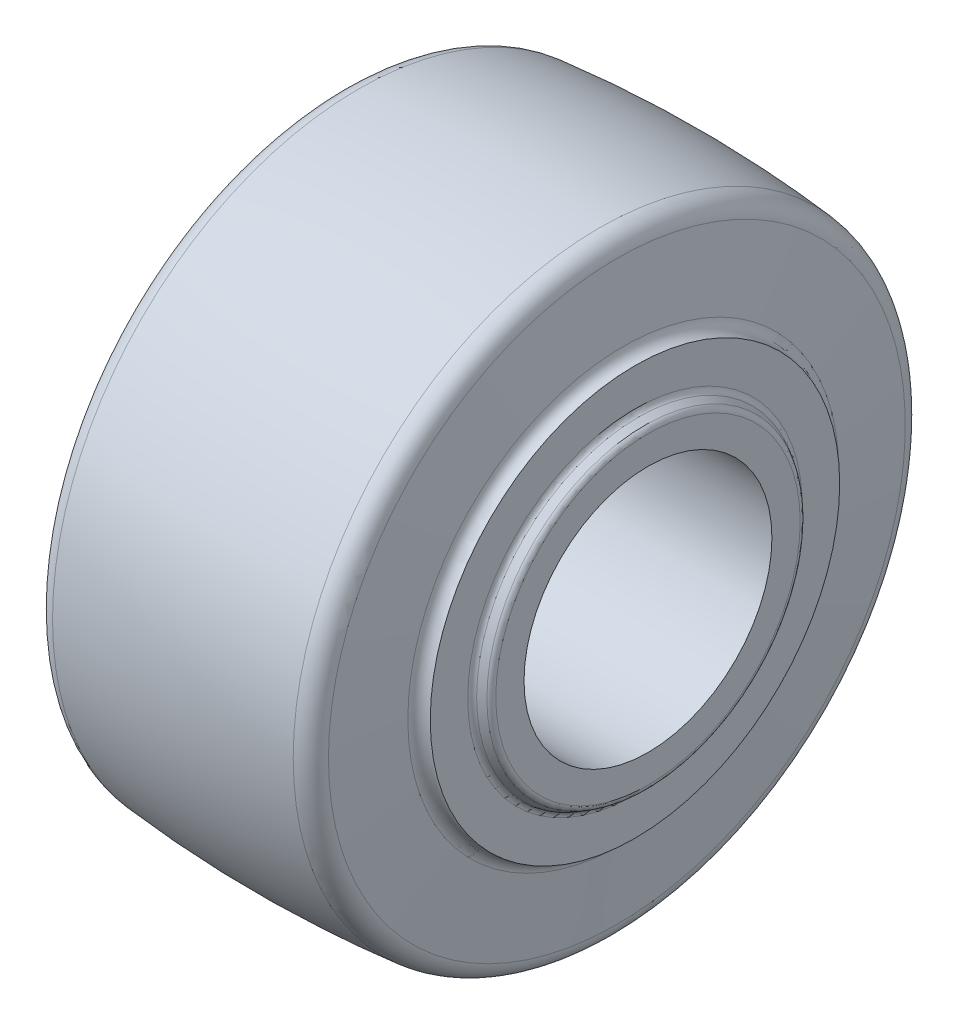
ISO-10303-21;
HEADER;
FILE_DESCRIPTION(('STEP AP214'),'2;1');
FILE_NAME('part.step','',(''),(''),'','','');
FILE_SCHEMA(('AUTOMOTIVE_DESIGN { 1 0 10303 214 1 1 1 1 }'));
ENDSEC;
DATA;
#1=APPLICATION_CONTEXT('core data for automotive mechanical design processes');
#2=APPLICATION_PROTOCOL_DEFINITION('international standard','automotive_design',2000,#1);
#3=PRODUCT_CONTEXT('',#1,'mechanical');
#4=PRODUCT('Part','Part','',(#3));
#5=PRODUCT_RELATED_PRODUCT_CATEGORY('part','',(#4));
#6=PRODUCT_DEFINITION_FORMATION('','',#4);
#7=PRODUCT_DEFINITION_CONTEXT('part definition',#1,'design');
#8=PRODUCT_DEFINITION('design','',#6,#7);
#9=PRODUCT_DEFINITION_SHAPE('','',#8);
#10=(LENGTH_UNIT() NAMED_UNIT(*) SI_UNIT(.MILLI.,.METRE.));
#11=(NAMED_UNIT(*) PLANE_ANGLE_UNIT() SI_UNIT($,.RADIAN.));
#12=(NAMED_UNIT(*) SI_UNIT($,.STERADIAN.) SOLID_ANGLE_UNIT());
#13=UNCERTAINTY_MEASURE_WITH_UNIT(LENGTH_MEASURE(1.E-05),#10,'distance_accuracy_value','');
#14=(GEOMETRIC_REPRESENTATION_CONTEXT(3) GLOBAL_UNCERTAINTY_ASSIGNED_CONTEXT((#13)) GLOBAL_UNIT_ASSIGNED_CONTEXT((#10,
#11,#12)) REPRESENTATION_CONTEXT('',''));
#15=CARTESIAN_POINT('',(0.,0.,0.));
#16=DIRECTION('',(0.,0.,1.));
#17=DIRECTION('',(1.,0.,0.));
#18=AXIS2_PLACEMENT_3D('',#15,#16,#17);
#19=CARTESIAN_POINT('',(-20.6375,18.5917282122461,0.));
#20=DIRECTION('',(1.,0.,0.));
#21=DIRECTION('',(0.,0.,-1.));
#22=AXIS2_PLACEMENT_3D('',#19,#20,#21);
#23=PLANE('',#22);
#24=CARTESIAN_POINT('',(-20.6375,0.,0.));
#25=DIRECTION('',(-1.,0.,0.));
#26=DIRECTION('',(0.,0.,1.));
#27=AXIS2_PLACEMENT_3D('',#24,#25,#26);
#28=CIRCLE('',#27,15.1384);
#29=CARTESIAN_POINT('',(-20.6375,0.,15.1384));
#30=VERTEX_POINT('',#29);
#31=EDGE_CURVE('E10',#30,#30,#28,.T.);
#32=ORIENTED_EDGE('',*,*,#31,.F.);
#33=EDGE_LOOP('',(#32));
#34=FACE_BOUND('',#33,.T.);
#35=CARTESIAN_POINT('',(-20.6375,0.,0.));
#36=DIRECTION('',(-1.,0.,0.));
#37=DIRECTION('',(0.,0.,1.));
#38=AXIS2_PLACEMENT_3D('',#35,#36,#37);
#39=CIRCLE('',#38,18.5917282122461);
#40=CARTESIAN_POINT('',(-20.6375,0.,18.5917282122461));
#41=VERTEX_POINT('',#40);
#42=EDGE_CURVE('E418',#41,#41,#39,.T.);
#43=ORIENTED_EDGE('',*,*,#42,.T.);
#44=EDGE_LOOP('',(#43));
#45=FACE_BOUND('',#44,.T.);
#46=ADVANCED_FACE('F360',(#34,#45),#23,.F.);
#47=CARTESIAN_POINT('',(-38.862204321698,0.,0.));
#48=DIRECTION('',(-1.,0.,0.));
#49=DIRECTION('',(0.,0.,1.));
#50=AXIS2_PLACEMENT_3D('',#47,#48,#49);
#51=CYLINDRICAL_SURFACE('',#50,15.1384);
#52=CARTESIAN_POINT('',(20.6375,0.,0.));
#53=DIRECTION('',(-1.,0.,0.));
#54=DIRECTION('',(0.,0.,1.));
#55=AXIS2_PLACEMENT_3D('',#52,#53,#54);
#56=CIRCLE('',#55,15.1384);
#57=CARTESIAN_POINT('',(20.6375,0.,15.1384));
#58=VERTEX_POINT('',#57);
#59=EDGE_CURVE('E366',#58,#58,#56,.T.);
#60=ORIENTED_EDGE('',*,*,#59,.F.);
#61=EDGE_LOOP('',(#60));
#62=FACE_BOUND('',#61,.T.);
#63=ORIENTED_EDGE('',*,*,#31,.T.);
#64=EDGE_LOOP('',(#63));
#65=FACE_BOUND('',#64,.T.);
#66=ADVANCED_FACE('F515',(#62,#65),#51,.F.);
#67=CARTESIAN_POINT('',(20.6375,15.1384,0.));
#68=DIRECTION('',(-1.,0.,0.));
#69=DIRECTION('',(0.,0.,1.));
#70=AXIS2_PLACEMENT_3D('',#67,#68,#69);
#71=PLANE('',#70);
#72=CARTESIAN_POINT('',(20.6375,0.,0.));
#73=DIRECTION('',(-1.,0.,0.));
#74=DIRECTION('',(0.,0.,1.));
#75=AXIS2_PLACEMENT_3D('',#72,#73,#74);
#76=CIRCLE('',#75,18.5917282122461);
#77=CARTESIAN_POINT('',(20.6375,0.,18.5917282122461));
#78=VERTEX_POINT('',#77);
#79=EDGE_CURVE('E370',#78,#78,#76,.T.);
#80=ORIENTED_EDGE('',*,*,#79,.F.);
#81=EDGE_LOOP('',(#80));
#82=FACE_BOUND('',#81,.T.);
#83=ORIENTED_EDGE('',*,*,#59,.T.);
#84=EDGE_LOOP('',(#83));
#85=FACE_BOUND('',#84,.T.);
#86=ADVANCED_FACE('F510',(#82,#85),#71,.F.);
#87=CARTESIAN_POINT('',(19.84375,0.,0.));
#88=DIRECTION('',(-1.,0.,0.));
#89=DIRECTION('',(0.,0.,1.));
#90=AXIS2_PLACEMENT_3D('',#87,#88,#89);
#91=TOROIDAL_SURFACE('',#90,18.5917282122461,0.793749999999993);
#92=CARTESIAN_POINT('',(20.2406249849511,0.,0.));
#93=DIRECTION('',(-1.,0.,0.));
#94=DIRECTION('',(0.,0.,1.));
#95=AXIS2_PLACEMENT_3D('',#92,#93,#94);
#96=CIRCLE('',#95,19.2791358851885);
#97=CARTESIAN_POINT('',(20.2406249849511,0.,19.2791358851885));
#98=VERTEX_POINT('',#97);
#99=EDGE_CURVE('E374',#98,#98,#96,.T.);
#100=ORIENTED_EDGE('',*,*,#99,.F.);
#101=EDGE_LOOP('',(#100));
#102=FACE_BOUND('',#101,.T.);
#103=ORIENTED_EDGE('',*,*,#79,.T.);
#104=EDGE_LOOP('',(#103));
#105=FACE_BOUND('',#104,.T.);
#106=ADVANCED_FACE('F504',(#102,#105),#91,.T.);
#107=CARTESIAN_POINT('',(20.2406249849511,0.,0.));
#108=DIRECTION('',(-1.,0.,0.));
#109=DIRECTION('',(0.,0.,1.));
#110=AXIS2_PLACEMENT_3D('',#107,#108,#109);
#111=CONICAL_SURFACE('',#110,19.2791358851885,0.523598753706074);
#112=CARTESIAN_POINT('',(19.4468750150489,0.,0.));
#113=DIRECTION('',(-1.,0.,0.));
#114=DIRECTION('',(0.,0.,1.));
#115=AXIS2_PLACEMENT_3D('',#112,#113,#114);
#116=CIRCLE('',#115,19.7374076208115);
#117=CARTESIAN_POINT('',(19.4468750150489,0.,19.7374076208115));
#118=VERTEX_POINT('',#117);
#119=EDGE_CURVE('E379',#118,#118,#116,.T.);
#120=ORIENTED_EDGE('',*,*,#119,.F.);
#121=EDGE_LOOP('',(#120));
#122=FACE_BOUND('',#121,.T.);
#123=ORIENTED_EDGE('',*,*,#99,.T.);
#124=EDGE_LOOP('',(#123));
#125=FACE_BOUND('',#124,.T.);
#126=ADVANCED_FACE('F498',(#122,#125),#111,.T.);
#127=CARTESIAN_POINT('',(19.84375,0.,0.));
#128=DIRECTION('',(-1.,0.,0.));
#129=DIRECTION('',(0.,0.,1.));
#130=AXIS2_PLACEMENT_3D('',#127,#128,#129);
#131=TOROIDAL_SURFACE('',#130,20.4248152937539,0.793750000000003);
#132=CARTESIAN_POINT('',(19.05,0.,0.));
#133=DIRECTION('',(-1.,0.,0.));
#134=DIRECTION('',(0.,0.,1.));
#135=AXIS2_PLACEMENT_3D('',#132,#133,#134);
#136=CIRCLE('',#135,20.4248152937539);
#137=CARTESIAN_POINT('',(19.05,0.,20.4248152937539));
#138=VERTEX_POINT('',#137);
#139=EDGE_CURVE('E382',#138,#138,#136,.T.);
#140=ORIENTED_EDGE('',*,*,#139,.F.);
#141=EDGE_LOOP('',(#140));
#142=FACE_BOUND('',#141,.T.);
#143=ORIENTED_EDGE('',*,*,#119,.T.);
#144=EDGE_LOOP('',(#143));
#145=FACE_BOUND('',#144,.T.);
#146=ADVANCED_FACE('F492',(#142,#145),#131,.F.);
#147=CARTESIAN_POINT('',(19.05,25.003125,0.));
#148=DIRECTION('',(-1.,0.,0.));
#149=DIRECTION('',(0.,0.,1.));
#150=AXIS2_PLACEMENT_3D('',#147,#148,#149);
#151=PLANE('',#150);
#152=CARTESIAN_POINT('',(19.05,0.,0.));
#153=DIRECTION('',(-1.,0.,0.));
#154=DIRECTION('',(0.,0.,1.));
#155=AXIS2_PLACEMENT_3D('',#152,#153,#154);
#156=CIRCLE('',#155,25.003125);
#157=CARTESIAN_POINT('',(19.05,0.,25.003125));
#158=VERTEX_POINT('',#157);
#159=EDGE_CURVE('E385',#158,#158,#156,.T.);
#160=ORIENTED_EDGE('',*,*,#159,.F.);
#161=EDGE_LOOP('',(#160));
#162=FACE_BOUND('',#161,.T.);
#163=ORIENTED_EDGE('',*,*,#139,.T.);
#164=EDGE_LOOP('',(#163));
#165=FACE_BOUND('',#164,.T.);
#166=ADVANCED_FACE('F486',(#162,#165),#151,.F.);
#167=CARTESIAN_POINT('',(19.05,0.,0.));
#168=DIRECTION('',(-1.,0.,0.));
#169=DIRECTION('',(0.,0.,1.));
#170=AXIS2_PLACEMENT_3D('',#167,#168,#169);
#171=TOROIDAL_SURFACE('',#170,26.4386476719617,1.43552267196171);
#172=CARTESIAN_POINT('',(17.6199399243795,0.,0.));
#173=DIRECTION('',(-1.,0.,0.));
#174=DIRECTION('',(0.,0.,1.));
#175=AXIS2_PLACEMENT_3D('',#172,#173,#174);
#176=CIRCLE('',#175,26.3135336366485);
#177=CARTESIAN_POINT('',(17.6199399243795,0.,26.3135336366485));
#178=VERTEX_POINT('',#177);
#179=EDGE_CURVE('E388',#178,#178,#176,.T.);
#180=ORIENTED_EDGE('',*,*,#179,.F.);
#181=EDGE_LOOP('',(#180));
#182=FACE_BOUND('',#181,.T.);
#183=ORIENTED_EDGE('',*,*,#159,.T.);
#184=EDGE_LOOP('',(#183));
#185=FACE_BOUND('',#184,.T.);
#186=ADVANCED_FACE('F480',(#182,#185),#171,.F.);
#187=CARTESIAN_POINT('',(17.6199399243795,0.,0.));
#188=DIRECTION('',(-1.,0.,0.));
#189=DIRECTION('',(0.,0.,1.));
#190=AXIS2_PLACEMENT_3D('',#187,#188,#189);
#191=CONICAL_SURFACE('',#190,26.3135336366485,1.48352987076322);
#192=CARTESIAN_POINT('',(16.8401117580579,0.,0.));
#193=DIRECTION('',(-1.,0.,0.));
#194=DIRECTION('',(0.,0.,1.));
#195=AXIS2_PLACEMENT_3D('',#192,#193,#194);
#196=CIRCLE('',#195,35.2270110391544);
#197=CARTESIAN_POINT('',(16.8401117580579,0.,35.2270110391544));
#198=VERTEX_POINT('',#197);
#199=EDGE_CURVE('E391',#198,#198,#196,.T.);
#200=ORIENTED_EDGE('',*,*,#199,.F.);
#201=EDGE_LOOP('',(#200));
#202=FACE_BOUND('',#201,.T.);
#203=ORIENTED_EDGE('',*,*,#179,.T.);
#204=EDGE_LOOP('',(#203));
#205=FACE_BOUND('',#204,.T.);
#206=ADVANCED_FACE('F474',(#202,#205),#191,.T.);
#207=CARTESIAN_POINT('',(14.4679231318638,0.,0.));
#208=DIRECTION('',(-1.,0.,0.));
#209=DIRECTION('',(0.,0.,1.));
#210=AXIS2_PLACEMENT_3D('',#207,#208,#209);
#211=TOROIDAL_SURFACE('',#210,35.0194714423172,2.38125);
#212=CARTESIAN_POINT('',(14.6975727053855,0.,0.));
#213=DIRECTION('',(-1.,0.,0.));
#214=DIRECTION('',(0.,0.,1.));
#215=AXIS2_PLACEMENT_3D('',#212,#213,#214);
#216=CIRCLE('',#215,37.3896217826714);
#217=CARTESIAN_POINT('',(14.6975727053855,0.,37.3896217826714));
#218=VERTEX_POINT('',#217);
#219=EDGE_CURVE('E394',#218,#218,#216,.T.);
#220=ORIENTED_EDGE('',*,*,#219,.F.);
#221=EDGE_LOOP('',(#220));
#222=FACE_BOUND('',#221,.T.);
#223=ORIENTED_EDGE('',*,*,#199,.T.);
#224=EDGE_LOOP('',(#223));
#225=FACE_BOUND('',#224,.T.);
#226=ADVANCED_FACE('F468',(#222,#225),#211,.T.);
#227=CARTESIAN_POINT('',(0.,0.,0.));
#228=DIRECTION('',(-1.,0.,0.));
#229=DIRECTION('',(0.,0.,1.));
#230=AXIS2_PLACEMENT_3D('',#227,#228,#229);
#231=DEGENERATE_TOROIDAL_SURFACE('',#230,114.3,152.4,.F.);
#232=CARTESIAN_POINT('',(-14.6975727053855,0.,0.));
#233=DIRECTION('',(-1.,0.,0.));
#234=DIRECTION('',(0.,0.,1.));
#235=AXIS2_PLACEMENT_3D('',#232,#233,#234);
#236=CIRCLE('',#235,37.3896217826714);
#237=CARTESIAN_POINT('',(-14.6975727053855,0.,37.3896217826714));
#238=VERTEX_POINT('',#237);
#239=EDGE_CURVE('E397',#238,#238,#236,.T.);
#240=ORIENTED_EDGE('',*,*,#239,.F.);
#241=EDGE_LOOP('',(#240));
#242=FACE_BOUND('',#241,.T.);
#243=ORIENTED_EDGE('',*,*,#219,.T.);
#244=EDGE_LOOP('',(#243));
#245=FACE_BOUND('',#244,.T.);
#246=ADVANCED_FACE('F462',(#242,#245),#231,.F.);
#247=CARTESIAN_POINT('',(-14.4679231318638,0.,0.));
#248=DIRECTION('',(-1.,0.,0.));
#249=DIRECTION('',(0.,0.,1.));
#250=AXIS2_PLACEMENT_3D('',#247,#248,#249);
#251=TOROIDAL_SURFACE('',#250,35.0194714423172,2.38124999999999);
#252=CARTESIAN_POINT('',(-16.8401117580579,0.,0.));
#253=DIRECTION('',(-1.,0.,0.));
#254=DIRECTION('',(0.,0.,1.));
#255=AXIS2_PLACEMENT_3D('',#252,#253,#254);
#256=CIRCLE('',#255,35.2270110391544);
#257=CARTESIAN_POINT('',(-16.8401117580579,0.,35.2270110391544));
#258=VERTEX_POINT('',#257);
#259=EDGE_CURVE('E400',#258,#258,#256,.T.);
#260=ORIENTED_EDGE('',*,*,#259,.F.);
#261=EDGE_LOOP('',(#260));
#262=FACE_BOUND('',#261,.T.);
#263=ORIENTED_EDGE('',*,*,#239,.T.);
#264=EDGE_LOOP('',(#263));
#265=FACE_BOUND('',#264,.T.);
#266=ADVANCED_FACE('F456',(#262,#265),#251,.T.);
#267=CARTESIAN_POINT('',(-16.8401117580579,0.,0.));
#268=DIRECTION('',(1.,0.,0.));
#269=DIRECTION('',(0.,0.,-1.));
#270=AXIS2_PLACEMENT_3D('',#267,#268,#269);
#271=CONICAL_SURFACE('',#270,35.2270110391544,1.48352987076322);
#272=CARTESIAN_POINT('',(-17.6199399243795,0.,0.));
#273=DIRECTION('',(-1.,0.,0.));
#274=DIRECTION('',(0.,0.,1.));
#275=AXIS2_PLACEMENT_3D('',#272,#273,#274);
#276=CIRCLE('',#275,26.3135336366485);
#277=CARTESIAN_POINT('',(-17.6199399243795,0.,26.3135336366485));
#278=VERTEX_POINT('',#277);
#279=EDGE_CURVE('E403',#278,#278,#276,.T.);
#280=ORIENTED_EDGE('',*,*,#279,.F.);
#281=EDGE_LOOP('',(#280));
#282=FACE_BOUND('',#281,.T.);
#283=ORIENTED_EDGE('',*,*,#259,.T.);
#284=EDGE_LOOP('',(#283));
#285=FACE_BOUND('',#284,.T.);
#286=ADVANCED_FACE('F450',(#282,#285),#271,.T.);
#287=CARTESIAN_POINT('',(-19.05,0.,0.));
#288=DIRECTION('',(-1.,0.,0.));
#289=DIRECTION('',(0.,0.,1.));
#290=AXIS2_PLACEMENT_3D('',#287,#288,#289);
#291=TOROIDAL_SURFACE('',#290,26.4386476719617,1.4355226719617);
#292=CARTESIAN_POINT('',(-19.05,0.,0.));
#293=DIRECTION('',(-1.,0.,0.));
#294=DIRECTION('',(0.,0.,1.));
#295=AXIS2_PLACEMENT_3D('',#292,#293,#294);
#296=CIRCLE('',#295,25.003125);
#297=CARTESIAN_POINT('',(-19.05,0.,25.003125));
#298=VERTEX_POINT('',#297);
#299=EDGE_CURVE('E406',#298,#298,#296,.T.);
#300=ORIENTED_EDGE('',*,*,#299,.F.);
#301=EDGE_LOOP('',(#300));
#302=FACE_BOUND('',#301,.T.);
#303=ORIENTED_EDGE('',*,*,#279,.T.);
#304=EDGE_LOOP('',(#303));
#305=FACE_BOUND('',#304,.T.);
#306=ADVANCED_FACE('F444',(#302,#305),#291,.F.);
#307=CARTESIAN_POINT('',(-19.05,25.003125,0.));
#308=DIRECTION('',(1.,0.,0.));
#309=DIRECTION('',(0.,0.,-1.));
#310=AXIS2_PLACEMENT_3D('',#307,#308,#309);
#311=PLANE('',#310);
#312=CARTESIAN_POINT('',(-19.05,0.,0.));
#313=DIRECTION('',(-1.,0.,0.));
#314=DIRECTION('',(0.,0.,1.));
#315=AXIS2_PLACEMENT_3D('',#312,#313,#314);
#316=CIRCLE('',#315,20.4248152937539);
#317=CARTESIAN_POINT('',(-19.05,0.,20.4248152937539));
#318=VERTEX_POINT('',#317);
#319=EDGE_CURVE('E409',#318,#318,#316,.T.);
#320=ORIENTED_EDGE('',*,*,#319,.F.);
#321=EDGE_LOOP('',(#320));
#322=FACE_BOUND('',#321,.T.);
#323=ORIENTED_EDGE('',*,*,#299,.T.);
#324=EDGE_LOOP('',(#323));
#325=FACE_BOUND('',#324,.T.);
#326=ADVANCED_FACE('F438',(#322,#325),#311,.F.);
#327=CARTESIAN_POINT('',(-19.84375,0.,0.));
#328=DIRECTION('',(-1.,0.,0.));
#329=DIRECTION('',(0.,0.,1.));
#330=AXIS2_PLACEMENT_3D('',#327,#328,#329);
#331=TOROIDAL_SURFACE('',#330,20.4248152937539,0.79375);
#332=CARTESIAN_POINT('',(-19.4468750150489,0.,0.));
#333=DIRECTION('',(-1.,0.,0.));
#334=DIRECTION('',(0.,0.,1.));
#335=AXIS2_PLACEMENT_3D('',#332,#333,#334);
#336=CIRCLE('',#335,19.7374076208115);
#337=CARTESIAN_POINT('',(-19.4468750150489,0.,19.7374076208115));
#338=VERTEX_POINT('',#337);
#339=EDGE_CURVE('E412',#338,#338,#336,.T.);
#340=ORIENTED_EDGE('',*,*,#339,.F.);
#341=EDGE_LOOP('',(#340));
#342=FACE_BOUND('',#341,.T.);
#343=ORIENTED_EDGE('',*,*,#319,.T.);
#344=EDGE_LOOP('',(#343));
#345=FACE_BOUND('',#344,.T.);
#346=ADVANCED_FACE('F432',(#342,#345),#331,.F.);
#347=CARTESIAN_POINT('',(-19.4468750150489,0.,0.));
#348=DIRECTION('',(1.,0.,0.));
#349=DIRECTION('',(0.,0.,-1.));
#350=AXIS2_PLACEMENT_3D('',#347,#348,#349);
#351=CONICAL_SURFACE('',#350,19.7374076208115,0.523598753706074);
#352=CARTESIAN_POINT('',(-20.2406249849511,0.,0.));
#353=DIRECTION('',(-1.,0.,0.));
#354=DIRECTION('',(0.,0.,1.));
#355=AXIS2_PLACEMENT_3D('',#352,#353,#354);
#356=CIRCLE('',#355,19.2791358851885);
#357=CARTESIAN_POINT('',(-20.2406249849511,0.,19.2791358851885));
#358=VERTEX_POINT('',#357);
#359=EDGE_CURVE('E415',#358,#358,#356,.T.);
#360=ORIENTED_EDGE('',*,*,#359,.F.);
#361=EDGE_LOOP('',(#360));
#362=FACE_BOUND('',#361,.T.);
#363=ORIENTED_EDGE('',*,*,#339,.T.);
#364=EDGE_LOOP('',(#363));
#365=FACE_BOUND('',#364,.T.);
#366=ADVANCED_FACE('F426',(#362,#365),#351,.T.);
#367=CARTESIAN_POINT('',(-19.84375,0.,0.));
#368=DIRECTION('',(-1.,0.,0.));
#369=DIRECTION('',(0.,0.,1.));
#370=AXIS2_PLACEMENT_3D('',#367,#368,#369);
#371=TOROIDAL_SURFACE('',#370,18.5917282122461,0.793750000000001);
#372=ORIENTED_EDGE('',*,*,#42,.F.);
#373=EDGE_LOOP('',(#372));
#374=FACE_BOUND('',#373,.T.);
#375=ORIENTED_EDGE('',*,*,#359,.T.);
#376=EDGE_LOOP('',(#375));
#377=FACE_BOUND('',#376,.T.);
#378=ADVANCED_FACE('F423',(#374,#377),#371,.T.);
#379=CLOSED_SHELL('',(#46,#66,#86,#106,#126,#146,#166,#186,#206,#226,#246,#266,#286,#306,#326,
#346,#366,#378));
#380=MANIFOLD_SOLID_BREP('B2',#379);
#381=ADVANCED_BREP_SHAPE_REPRESENTATION('',(#18,#380),#14);
#382=SHAPE_DEFINITION_REPRESENTATION(#9,#381);
ENDSEC;
END-ISO-10303-21;
